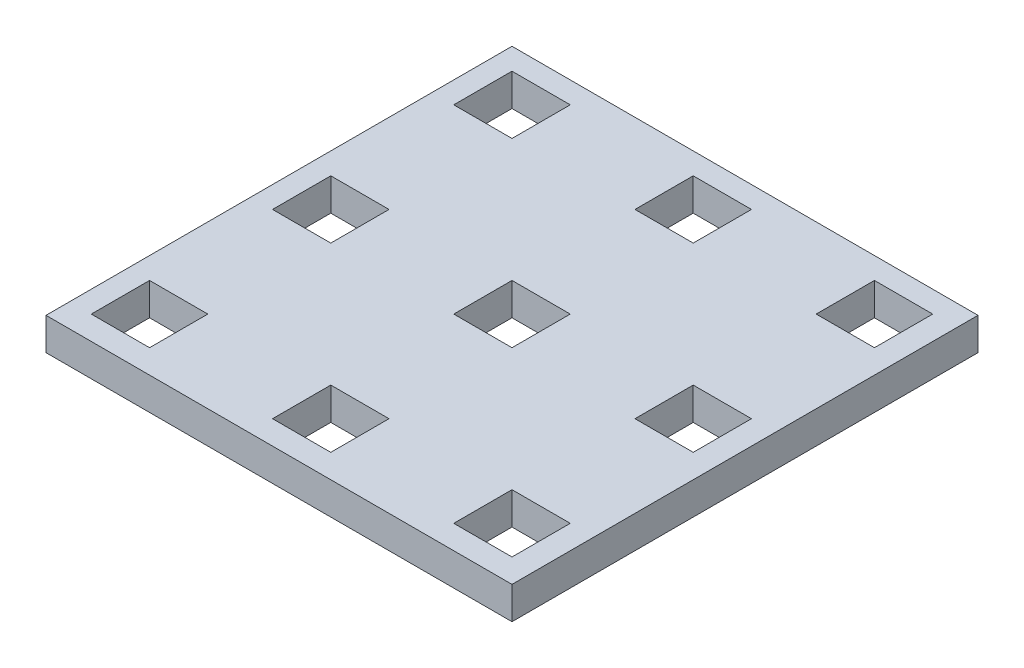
ISO-10303-21;
HEADER;
FILE_DESCRIPTION(('STEP AP214'),'2;1');
FILE_NAME('part.step','',(''),(''),'','','');
FILE_SCHEMA(('AUTOMOTIVE_DESIGN { 1 0 10303 214 1 1 1 1 }'));
ENDSEC;
DATA;
#1=APPLICATION_CONTEXT('core data for automotive mechanical design processes');
#2=APPLICATION_PROTOCOL_DEFINITION('international standard','automotive_design',2000,#1);
#3=PRODUCT_CONTEXT('',#1,'mechanical');
#4=PRODUCT('Part','Part','',(#3));
#5=PRODUCT_RELATED_PRODUCT_CATEGORY('part','',(#4));
#6=PRODUCT_DEFINITION_FORMATION('','',#4);
#7=PRODUCT_DEFINITION_CONTEXT('part definition',#1,'design');
#8=PRODUCT_DEFINITION('design','',#6,#7);
#9=PRODUCT_DEFINITION_SHAPE('','',#8);
#10=(LENGTH_UNIT() NAMED_UNIT(*) SI_UNIT(.MILLI.,.METRE.));
#11=(NAMED_UNIT(*) PLANE_ANGLE_UNIT() SI_UNIT($,.RADIAN.));
#12=(NAMED_UNIT(*) SI_UNIT($,.STERADIAN.) SOLID_ANGLE_UNIT());
#13=UNCERTAINTY_MEASURE_WITH_UNIT(LENGTH_MEASURE(1.E-05),#10,'distance_accuracy_value','');
#14=(GEOMETRIC_REPRESENTATION_CONTEXT(3) GLOBAL_UNCERTAINTY_ASSIGNED_CONTEXT((#13)) GLOBAL_UNIT_ASSIGNED_CONTEXT((#10,
#11,#12)) REPRESENTATION_CONTEXT('',''));
#15=CARTESIAN_POINT('',(0.,0.,0.));
#16=DIRECTION('',(0.,0.,1.));
#17=DIRECTION('',(1.,0.,0.));
#18=AXIS2_PLACEMENT_3D('',#15,#16,#17);
#19=CARTESIAN_POINT('',(21.6,3.,-21.6));
#20=DIRECTION('',(-1.,0.,0.));
#21=DIRECTION('',(0.,0.,1.));
#22=AXIS2_PLACEMENT_3D('',#19,#20,#21);
#23=PLANE('',#22);
#24=DIRECTION('',(0.,0.,-1.));
#25=VECTOR('',#24,1.);
#26=CARTESIAN_POINT('',(21.6,0.,-21.6));
#27=LINE('',#26,#25);
#28=CARTESIAN_POINT('',(21.6,0.,21.6));
#29=VERTEX_POINT('',#28);
#30=CARTESIAN_POINT('',(21.6,0.,-21.6));
#31=VERTEX_POINT('',#30);
#32=EDGE_CURVE('E577',#29,#31,#27,.T.);
#33=ORIENTED_EDGE('',*,*,#32,.T.);
#34=DIRECTION('',(0.,-1.,0.));
#35=VECTOR('',#34,1.);
#36=CARTESIAN_POINT('',(21.6,3.,-21.6));
#37=LINE('',#36,#35);
#38=CARTESIAN_POINT('',(21.6,3.,-21.6));
#39=VERTEX_POINT('',#38);
#40=EDGE_CURVE('E11',#39,#31,#37,.T.);
#41=ORIENTED_EDGE('',*,*,#40,.F.);
#42=DIRECTION('',(0.,0.,-1.));
#43=VECTOR('',#42,1.);
#44=CARTESIAN_POINT('',(21.6,3.,-21.6));
#45=LINE('',#44,#43);
#46=CARTESIAN_POINT('',(21.6,3.,21.6));
#47=VERTEX_POINT('',#46);
#48=EDGE_CURVE('E584',#47,#39,#45,.T.);
#49=ORIENTED_EDGE('',*,*,#48,.F.);
#50=DIRECTION('',(0.,-1.,0.));
#51=VECTOR('',#50,1.);
#52=CARTESIAN_POINT('',(21.6,3.,21.6));
#53=LINE('',#52,#51);
#54=EDGE_CURVE('E594',#47,#29,#53,.T.);
#55=ORIENTED_EDGE('',*,*,#54,.T.);
#56=EDGE_LOOP('',(#33,#41,#49,#55));
#57=FACE_BOUND('',#56,.T.);
#58=ADVANCED_FACE('F35',(#57),#23,.F.);
#59=CARTESIAN_POINT('',(-21.6,3.,-21.6));
#60=DIRECTION('',(0.,0.,1.));
#61=DIRECTION('',(1.,0.,0.));
#62=AXIS2_PLACEMENT_3D('',#59,#60,#61);
#63=PLANE('',#62);
#64=DIRECTION('',(-1.,0.,0.));
#65=VECTOR('',#64,1.);
#66=CARTESIAN_POINT('',(-21.6,0.,-21.6));
#67=LINE('',#66,#65);
#68=CARTESIAN_POINT('',(-21.6,0.,-21.6));
#69=VERTEX_POINT('',#68);
#70=EDGE_CURVE('E597',#31,#69,#67,.T.);
#71=ORIENTED_EDGE('',*,*,#70,.T.);
#72=DIRECTION('',(0.,-1.,0.));
#73=VECTOR('',#72,1.);
#74=CARTESIAN_POINT('',(-21.6,3.,-21.6));
#75=LINE('',#74,#73);
#76=CARTESIAN_POINT('',(-21.6,3.,-21.6));
#77=VERTEX_POINT('',#76);
#78=EDGE_CURVE('E42',#77,#69,#75,.T.);
#79=ORIENTED_EDGE('',*,*,#78,.F.);
#80=DIRECTION('',(-1.,0.,0.));
#81=VECTOR('',#80,1.);
#82=CARTESIAN_POINT('',(-21.6,3.,-21.6));
#83=LINE('',#82,#81);
#84=EDGE_CURVE('E587',#39,#77,#83,.T.);
#85=ORIENTED_EDGE('',*,*,#84,.F.);
#86=ORIENTED_EDGE('',*,*,#40,.T.);
#87=EDGE_LOOP('',(#71,#79,#85,#86));
#88=FACE_BOUND('',#87,.T.);
#89=ADVANCED_FACE('F626',(#88),#63,.F.);
#90=CARTESIAN_POINT('',(-21.6,3.,-21.6));
#91=DIRECTION('',(1.,0.,0.));
#92=DIRECTION('',(0.,0.,-1.));
#93=AXIS2_PLACEMENT_3D('',#90,#91,#92);
#94=PLANE('',#93);
#95=DIRECTION('',(0.,0.,1.));
#96=VECTOR('',#95,1.);
#97=CARTESIAN_POINT('',(-21.6,0.,-21.6));
#98=LINE('',#97,#96);
#99=CARTESIAN_POINT('',(-21.6,0.,21.6));
#100=VERTEX_POINT('',#99);
#101=EDGE_CURVE('E599',#69,#100,#98,.T.);
#102=ORIENTED_EDGE('',*,*,#101,.T.);
#103=DIRECTION('',(0.,-1.,0.));
#104=VECTOR('',#103,1.);
#105=CARTESIAN_POINT('',(-21.6,3.,21.6));
#106=LINE('',#105,#104);
#107=CARTESIAN_POINT('',(-21.6,3.,21.6));
#108=VERTEX_POINT('',#107);
#109=EDGE_CURVE('E604',#108,#100,#106,.T.);
#110=ORIENTED_EDGE('',*,*,#109,.F.);
#111=DIRECTION('',(0.,0.,1.));
#112=VECTOR('',#111,1.);
#113=CARTESIAN_POINT('',(-21.6,3.,-21.6));
#114=LINE('',#113,#112);
#115=EDGE_CURVE('E590',#77,#108,#114,.T.);
#116=ORIENTED_EDGE('',*,*,#115,.F.);
#117=ORIENTED_EDGE('',*,*,#78,.T.);
#118=EDGE_LOOP('',(#102,#110,#116,#117));
#119=FACE_BOUND('',#118,.T.);
#120=ADVANCED_FACE('F611',(#119),#94,.F.);
#121=CARTESIAN_POINT('',(-21.6,3.,21.6));
#122=DIRECTION('',(0.,0.,-1.));
#123=DIRECTION('',(-1.,0.,0.));
#124=AXIS2_PLACEMENT_3D('',#121,#122,#123);
#125=PLANE('',#124);
#126=DIRECTION('',(1.,0.,0.));
#127=VECTOR('',#126,1.);
#128=CARTESIAN_POINT('',(-21.6,0.,21.6));
#129=LINE('',#128,#127);
#130=EDGE_CURVE('E588',#100,#29,#129,.T.);
#131=ORIENTED_EDGE('',*,*,#130,.T.);
#132=ORIENTED_EDGE('',*,*,#54,.F.);
#133=DIRECTION('',(1.,0.,0.));
#134=VECTOR('',#133,1.);
#135=CARTESIAN_POINT('',(-21.6,3.,21.6));
#136=LINE('',#135,#134);
#137=EDGE_CURVE('E592',#108,#47,#136,.T.);
#138=ORIENTED_EDGE('',*,*,#137,.F.);
#139=ORIENTED_EDGE('',*,*,#109,.T.);
#140=EDGE_LOOP('',(#131,#132,#138,#139));
#141=FACE_BOUND('',#140,.T.);
#142=ADVANCED_FACE('F619',(#141),#125,.F.);
#143=CARTESIAN_POINT('',(0.,3.,0.));
#144=DIRECTION('',(0.,1.,0.));
#145=DIRECTION('',(0.,0.,1.));
#146=AXIS2_PLACEMENT_3D('',#143,#144,#145);
#147=PLANE('',#146);
#148=DIRECTION('',(1.,0.,0.));
#149=VECTOR('',#148,1.);
#150=CARTESIAN_POINT('',(-19.5999999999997,3.,19.4));
#151=LINE('',#150,#149);
#152=CARTESIAN_POINT('',(-19.5999999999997,3.,19.4));
#153=VERTEX_POINT('',#152);
#154=CARTESIAN_POINT('',(-14.1999999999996,3.,19.4));
#155=VERTEX_POINT('',#154);
#156=EDGE_CURVE('E49',#153,#155,#151,.T.);
#157=ORIENTED_EDGE('',*,*,#156,.F.);
#158=DIRECTION('',(0.,0.,1.));
#159=VECTOR('',#158,1.);
#160=CARTESIAN_POINT('',(-19.5999999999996,3.,14.));
#161=LINE('',#160,#159);
#162=CARTESIAN_POINT('',(-19.5999999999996,3.,14.));
#163=VERTEX_POINT('',#162);
#164=EDGE_CURVE('E309',#163,#153,#161,.T.);
#165=ORIENTED_EDGE('',*,*,#164,.F.);
#166=DIRECTION('',(-1.,0.,0.));
#167=VECTOR('',#166,1.);
#168=CARTESIAN_POINT('',(-19.5999999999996,3.,14.));
#169=LINE('',#168,#167);
#170=CARTESIAN_POINT('',(-14.1999999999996,3.,14.));
#171=VERTEX_POINT('',#170);
#172=EDGE_CURVE('E312',#171,#163,#169,.T.);
#173=ORIENTED_EDGE('',*,*,#172,.F.);
#174=DIRECTION('',(0.,0.,-1.));
#175=VECTOR('',#174,1.);
#176=CARTESIAN_POINT('',(-14.1999999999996,3.,14.));
#177=LINE('',#176,#175);
#178=EDGE_CURVE('E318',#155,#171,#177,.T.);
#179=ORIENTED_EDGE('',*,*,#178,.F.);
#180=EDGE_LOOP('',(#157,#165,#173,#179));
#181=FACE_BOUND('',#180,.T.);
#182=DIRECTION('',(1.,0.,0.));
#183=VECTOR('',#182,1.);
#184=CARTESIAN_POINT('',(-19.5999999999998,3.,2.6));
#185=LINE('',#184,#183);
#186=CARTESIAN_POINT('',(-19.5999999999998,3.,2.6));
#187=VERTEX_POINT('',#186);
#188=CARTESIAN_POINT('',(-14.1999999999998,3.,2.6));
#189=VERTEX_POINT('',#188);
#190=EDGE_CURVE('E324',#187,#189,#185,.T.);
#191=ORIENTED_EDGE('',*,*,#190,.F.);
#192=DIRECTION('',(0.,0.,1.));
#193=VECTOR('',#192,1.);
#194=CARTESIAN_POINT('',(-19.5999999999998,3.,-2.8));
#195=LINE('',#194,#193);
#196=CARTESIAN_POINT('',(-19.5999999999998,3.,-2.8));
#197=VERTEX_POINT('',#196);
#198=EDGE_CURVE('E332',#197,#187,#195,.T.);
#199=ORIENTED_EDGE('',*,*,#198,.F.);
#200=DIRECTION('',(-1.,0.,0.));
#201=VECTOR('',#200,1.);
#202=CARTESIAN_POINT('',(-19.5999999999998,3.,-2.8));
#203=LINE('',#202,#201);
#204=CARTESIAN_POINT('',(-14.1999999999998,3.,-2.79999999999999));
#205=VERTEX_POINT('',#204);
#206=EDGE_CURVE('E346',#205,#197,#203,.T.);
#207=ORIENTED_EDGE('',*,*,#206,.F.);
#208=DIRECTION('',(0.,0.,-1.));
#209=VECTOR('',#208,1.);
#210=CARTESIAN_POINT('',(-14.1999999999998,3.,-2.79999999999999));
#211=LINE('',#210,#209);
#212=EDGE_CURVE('E343',#189,#205,#211,.T.);
#213=ORIENTED_EDGE('',*,*,#212,.F.);
#214=EDGE_LOOP('',(#191,#199,#207,#213));
#215=FACE_BOUND('',#214,.T.);
#216=DIRECTION('',(1.,0.,0.));
#217=VECTOR('',#216,1.);
#218=CARTESIAN_POINT('',(14.0000000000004,3.,19.3999999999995));
#219=LINE('',#218,#217);
#220=CARTESIAN_POINT('',(14.0000000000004,3.,19.3999999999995));
#221=VERTEX_POINT('',#220);
#222=CARTESIAN_POINT('',(19.4000000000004,3.,19.3999999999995));
#223=VERTEX_POINT('',#222);
#224=EDGE_CURVE('E353',#221,#223,#219,.T.);
#225=ORIENTED_EDGE('',*,*,#224,.F.);
#226=DIRECTION('',(0.,0.,1.));
#227=VECTOR('',#226,1.);
#228=CARTESIAN_POINT('',(14.0000000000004,3.,13.9999999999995));
#229=LINE('',#228,#227);
#230=CARTESIAN_POINT('',(14.0000000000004,3.,13.9999999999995));
#231=VERTEX_POINT('',#230);
#232=EDGE_CURVE('E364',#231,#221,#229,.T.);
#233=ORIENTED_EDGE('',*,*,#232,.F.);
#234=DIRECTION('',(-1.,0.,0.));
#235=VECTOR('',#234,1.);
#236=CARTESIAN_POINT('',(14.0000000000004,3.,13.9999999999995));
#237=LINE('',#236,#235);
#238=CARTESIAN_POINT('',(19.4000000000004,3.,13.9999999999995));
#239=VERTEX_POINT('',#238);
#240=EDGE_CURVE('E378',#239,#231,#237,.T.);
#241=ORIENTED_EDGE('',*,*,#240,.F.);
#242=DIRECTION('',(0.,0.,-1.));
#243=VECTOR('',#242,1.);
#244=CARTESIAN_POINT('',(19.4000000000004,3.,13.9999999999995));
#245=LINE('',#244,#243);
#246=EDGE_CURVE('E375',#223,#239,#245,.T.);
#247=ORIENTED_EDGE('',*,*,#246,.F.);
#248=EDGE_LOOP('',(#225,#233,#241,#247));
#249=FACE_BOUND('',#248,.T.);
#250=DIRECTION('',(1.,0.,0.));
#251=VECTOR('',#250,1.);
#252=CARTESIAN_POINT('',(-2.79999999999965,3.,19.3999999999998));
#253=LINE('',#252,#251);
#254=CARTESIAN_POINT('',(-2.79999999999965,3.,19.3999999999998));
#255=VERTEX_POINT('',#254);
#256=CARTESIAN_POINT('',(2.60000000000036,3.,19.3999999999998));
#257=VERTEX_POINT('',#256);
#258=EDGE_CURVE('E385',#255,#257,#253,.T.);
#259=ORIENTED_EDGE('',*,*,#258,.F.);
#260=DIRECTION('',(0.,0.,1.));
#261=VECTOR('',#260,1.);
#262=CARTESIAN_POINT('',(-2.79999999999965,3.,13.9999999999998));
#263=LINE('',#262,#261);
#264=CARTESIAN_POINT('',(-2.79999999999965,3.,13.9999999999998));
#265=VERTEX_POINT('',#264);
#266=EDGE_CURVE('E396',#265,#255,#263,.T.);
#267=ORIENTED_EDGE('',*,*,#266,.F.);
#268=DIRECTION('',(-1.,0.,0.));
#269=VECTOR('',#268,1.);
#270=CARTESIAN_POINT('',(-2.79999999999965,3.,13.9999999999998));
#271=LINE('',#270,#269);
#272=CARTESIAN_POINT('',(2.60000000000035,3.,13.9999999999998));
#273=VERTEX_POINT('',#272);
#274=EDGE_CURVE('E410',#273,#265,#271,.T.);
#275=ORIENTED_EDGE('',*,*,#274,.F.);
#276=DIRECTION('',(0.,0.,-1.));
#277=VECTOR('',#276,1.);
#278=CARTESIAN_POINT('',(2.60000000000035,3.,13.9999999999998));
#279=LINE('',#278,#277);
#280=EDGE_CURVE('E407',#257,#273,#279,.T.);
#281=ORIENTED_EDGE('',*,*,#280,.F.);
#282=EDGE_LOOP('',(#259,#267,#275,#281));
#283=FACE_BOUND('',#282,.T.);
#284=DIRECTION('',(1.,0.,0.));
#285=VECTOR('',#284,1.);
#286=CARTESIAN_POINT('',(14.0000000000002,3.,2.59999999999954));
#287=LINE('',#286,#285);
#288=CARTESIAN_POINT('',(14.0000000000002,3.,2.59999999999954));
#289=VERTEX_POINT('',#288);
#290=CARTESIAN_POINT('',(19.4000000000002,3.,2.59999999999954));
#291=VERTEX_POINT('',#290);
#292=EDGE_CURVE('E417',#289,#291,#287,.T.);
#293=ORIENTED_EDGE('',*,*,#292,.F.);
#294=DIRECTION('',(0.,0.,1.));
#295=VECTOR('',#294,1.);
#296=CARTESIAN_POINT('',(14.0000000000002,3.,-2.80000000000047));
#297=LINE('',#296,#295);
#298=CARTESIAN_POINT('',(14.0000000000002,3.,-2.80000000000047));
#299=VERTEX_POINT('',#298);
#300=EDGE_CURVE('E428',#299,#289,#297,.T.);
#301=ORIENTED_EDGE('',*,*,#300,.F.);
#302=DIRECTION('',(-1.,0.,0.));
#303=VECTOR('',#302,1.);
#304=CARTESIAN_POINT('',(14.0000000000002,3.,-2.80000000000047));
#305=LINE('',#304,#303);
#306=CARTESIAN_POINT('',(19.4000000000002,3.,-2.80000000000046));
#307=VERTEX_POINT('',#306);
#308=EDGE_CURVE('E442',#307,#299,#305,.T.);
#309=ORIENTED_EDGE('',*,*,#308,.F.);
#310=DIRECTION('',(0.,0.,-1.));
#311=VECTOR('',#310,1.);
#312=CARTESIAN_POINT('',(19.4000000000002,3.,-2.80000000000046));
#313=LINE('',#312,#311);
#314=EDGE_CURVE('E439',#291,#307,#313,.T.);
#315=ORIENTED_EDGE('',*,*,#314,.F.);
#316=EDGE_LOOP('',(#293,#301,#309,#315));
#317=FACE_BOUND('',#316,.T.);
#318=DIRECTION('',(1.,0.,0.));
#319=VECTOR('',#318,1.);
#320=CARTESIAN_POINT('',(-2.79999999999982,3.,2.59999999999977));
#321=LINE('',#320,#319);
#322=CARTESIAN_POINT('',(-2.79999999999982,3.,2.59999999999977));
#323=VERTEX_POINT('',#322);
#324=CARTESIAN_POINT('',(2.60000000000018,3.,2.59999999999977));
#325=VERTEX_POINT('',#324);
#326=EDGE_CURVE('E449',#323,#325,#321,.T.);
#327=ORIENTED_EDGE('',*,*,#326,.F.);
#328=DIRECTION('',(0.,0.,1.));
#329=VECTOR('',#328,1.);
#330=CARTESIAN_POINT('',(-2.79999999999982,3.,-2.80000000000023));
#331=LINE('',#330,#329);
#332=CARTESIAN_POINT('',(-2.79999999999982,3.,-2.80000000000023));
#333=VERTEX_POINT('',#332);
#334=EDGE_CURVE('E460',#333,#323,#331,.T.);
#335=ORIENTED_EDGE('',*,*,#334,.F.);
#336=DIRECTION('',(-1.,0.,0.));
#337=VECTOR('',#336,1.);
#338=CARTESIAN_POINT('',(-2.79999999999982,3.,-2.80000000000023));
#339=LINE('',#338,#337);
#340=CARTESIAN_POINT('',(2.60000000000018,3.,-2.80000000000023));
#341=VERTEX_POINT('',#340);
#342=EDGE_CURVE('E474',#341,#333,#339,.T.);
#343=ORIENTED_EDGE('',*,*,#342,.F.);
#344=DIRECTION('',(0.,0.,-1.));
#345=VECTOR('',#344,1.);
#346=CARTESIAN_POINT('',(2.60000000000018,3.,-2.80000000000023));
#347=LINE('',#346,#345);
#348=EDGE_CURVE('E471',#325,#341,#347,.T.);
#349=ORIENTED_EDGE('',*,*,#348,.F.);
#350=EDGE_LOOP('',(#327,#335,#343,#349));
#351=FACE_BOUND('',#350,.T.);
#352=DIRECTION('',(1.,0.,0.));
#353=VECTOR('',#352,1.);
#354=CARTESIAN_POINT('',(14.,3.,-14.2000000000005));
#355=LINE('',#354,#353);
#356=CARTESIAN_POINT('',(14.,3.,-14.2000000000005));
#357=VERTEX_POINT('',#356);
#358=CARTESIAN_POINT('',(19.4,3.,-14.2000000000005));
#359=VERTEX_POINT('',#358);
#360=EDGE_CURVE('E481',#357,#359,#355,.T.);
#361=ORIENTED_EDGE('',*,*,#360,.F.);
#362=DIRECTION('',(0.,0.,1.));
#363=VECTOR('',#362,1.);
#364=CARTESIAN_POINT('',(14.,3.,-19.6000000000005));
#365=LINE('',#364,#363);
#366=CARTESIAN_POINT('',(14.,3.,-19.6000000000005));
#367=VERTEX_POINT('',#366);
#368=EDGE_CURVE('E492',#367,#357,#365,.T.);
#369=ORIENTED_EDGE('',*,*,#368,.F.);
#370=DIRECTION('',(-1.,0.,0.));
#371=VECTOR('',#370,1.);
#372=CARTESIAN_POINT('',(14.,3.,-19.6000000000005));
#373=LINE('',#372,#371);
#374=CARTESIAN_POINT('',(19.4,3.,-19.6000000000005));
#375=VERTEX_POINT('',#374);
#376=EDGE_CURVE('E506',#375,#367,#373,.T.);
#377=ORIENTED_EDGE('',*,*,#376,.F.);
#378=DIRECTION('',(0.,0.,-1.));
#379=VECTOR('',#378,1.);
#380=CARTESIAN_POINT('',(19.4,3.,-19.6000000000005));
#381=LINE('',#380,#379);
#382=EDGE_CURVE('E503',#359,#375,#381,.T.);
#383=ORIENTED_EDGE('',*,*,#382,.F.);
#384=EDGE_LOOP('',(#361,#369,#377,#383));
#385=FACE_BOUND('',#384,.T.);
#386=DIRECTION('',(1.,0.,0.));
#387=VECTOR('',#386,1.);
#388=CARTESIAN_POINT('',(-2.8,3.,-14.2000000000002));
#389=LINE('',#388,#387);
#390=CARTESIAN_POINT('',(-2.8,3.,-14.2000000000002));
#391=VERTEX_POINT('',#390);
#392=CARTESIAN_POINT('',(2.6,3.,-14.2000000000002));
#393=VERTEX_POINT('',#392);
#394=EDGE_CURVE('E513',#391,#393,#389,.T.);
#395=ORIENTED_EDGE('',*,*,#394,.F.);
#396=DIRECTION('',(0.,0.,1.));
#397=VECTOR('',#396,1.);
#398=CARTESIAN_POINT('',(-2.8,3.,-19.6000000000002));
#399=LINE('',#398,#397);
#400=CARTESIAN_POINT('',(-2.8,3.,-19.6000000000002));
#401=VERTEX_POINT('',#400);
#402=EDGE_CURVE('E524',#401,#391,#399,.T.);
#403=ORIENTED_EDGE('',*,*,#402,.F.);
#404=DIRECTION('',(-1.,0.,0.));
#405=VECTOR('',#404,1.);
#406=CARTESIAN_POINT('',(-2.8,3.,-19.6000000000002));
#407=LINE('',#406,#405);
#408=CARTESIAN_POINT('',(2.6,3.,-19.6000000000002));
#409=VERTEX_POINT('',#408);
#410=EDGE_CURVE('E538',#409,#401,#407,.T.);
#411=ORIENTED_EDGE('',*,*,#410,.F.);
#412=DIRECTION('',(0.,0.,-1.));
#413=VECTOR('',#412,1.);
#414=CARTESIAN_POINT('',(2.6,3.,-19.6000000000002));
#415=LINE('',#414,#413);
#416=EDGE_CURVE('E535',#393,#409,#415,.T.);
#417=ORIENTED_EDGE('',*,*,#416,.F.);
#418=EDGE_LOOP('',(#395,#403,#411,#417));
#419=FACE_BOUND('',#418,.T.);
#420=DIRECTION('',(0.,0.,-1.));
#421=VECTOR('',#420,1.);
#422=CARTESIAN_POINT('',(-14.2,3.,-19.6));
#423=LINE('',#422,#421);
#424=CARTESIAN_POINT('',(-14.2,3.,-14.2));
#425=VERTEX_POINT('',#424);
#426=CARTESIAN_POINT('',(-14.2,3.,-19.6));
#427=VERTEX_POINT('',#426);
#428=EDGE_CURVE('E545',#425,#427,#423,.T.);
#429=ORIENTED_EDGE('',*,*,#428,.F.);
#430=DIRECTION('',(1.,0.,0.));
#431=VECTOR('',#430,1.);
#432=CARTESIAN_POINT('',(-19.6,3.,-14.2));
#433=LINE('',#432,#431);
#434=CARTESIAN_POINT('',(-19.6,3.,-14.2));
#435=VERTEX_POINT('',#434);
#436=EDGE_CURVE('E556',#435,#425,#433,.T.);
#437=ORIENTED_EDGE('',*,*,#436,.F.);
#438=DIRECTION('',(0.,0.,1.));
#439=VECTOR('',#438,1.);
#440=CARTESIAN_POINT('',(-19.6,3.,-19.6));
#441=LINE('',#440,#439);
#442=CARTESIAN_POINT('',(-19.6,3.,-19.6));
#443=VERTEX_POINT('',#442);
#444=EDGE_CURVE('E570',#443,#435,#441,.T.);
#445=ORIENTED_EDGE('',*,*,#444,.F.);
#446=DIRECTION('',(-1.,0.,0.));
#447=VECTOR('',#446,1.);
#448=CARTESIAN_POINT('',(-19.6,3.,-19.6));
#449=LINE('',#448,#447);
#450=EDGE_CURVE('E567',#427,#443,#449,.T.);
#451=ORIENTED_EDGE('',*,*,#450,.F.);
#452=EDGE_LOOP('',(#429,#437,#445,#451));
#453=FACE_BOUND('',#452,.T.);
#454=ORIENTED_EDGE('',*,*,#48,.T.);
#455=ORIENTED_EDGE('',*,*,#84,.T.);
#456=ORIENTED_EDGE('',*,*,#115,.T.);
#457=ORIENTED_EDGE('',*,*,#137,.T.);
#458=EDGE_LOOP('',(#454,#455,#456,#457));
#459=FACE_BOUND('',#458,.T.);
#460=ADVANCED_FACE('F625',(#181,#215,#249,#283,#317,#351,#385,#419,#453,#459),#147,.T.);
#461=CARTESIAN_POINT('',(0.,0.,0.));
#462=DIRECTION('',(0.,1.,0.));
#463=DIRECTION('',(0.,0.,1.));
#464=AXIS2_PLACEMENT_3D('',#461,#462,#463);
#465=PLANE('',#464);
#466=DIRECTION('',(0.,0.,1.));
#467=VECTOR('',#466,1.);
#468=CARTESIAN_POINT('',(-19.5999999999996,0.,14.));
#469=LINE('',#468,#467);
#470=CARTESIAN_POINT('',(-19.5999999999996,0.,14.));
#471=VERTEX_POINT('',#470);
#472=CARTESIAN_POINT('',(-19.5999999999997,0.,19.4));
#473=VERTEX_POINT('',#472);
#474=EDGE_CURVE('E299',#471,#473,#469,.T.);
#475=ORIENTED_EDGE('',*,*,#474,.T.);
#476=DIRECTION('',(1.,0.,0.));
#477=VECTOR('',#476,1.);
#478=CARTESIAN_POINT('',(-19.5999999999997,0.,19.4));
#479=LINE('',#478,#477);
#480=CARTESIAN_POINT('',(-14.1999999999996,0.,19.4));
#481=VERTEX_POINT('',#480);
#482=EDGE_CURVE('E293',#473,#481,#479,.T.);
#483=ORIENTED_EDGE('',*,*,#482,.T.);
#484=DIRECTION('',(0.,0.,-1.));
#485=VECTOR('',#484,1.);
#486=CARTESIAN_POINT('',(-14.1999999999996,0.,14.));
#487=LINE('',#486,#485);
#488=CARTESIAN_POINT('',(-14.1999999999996,0.,14.));
#489=VERTEX_POINT('',#488);
#490=EDGE_CURVE('E302',#481,#489,#487,.T.);
#491=ORIENTED_EDGE('',*,*,#490,.T.);
#492=DIRECTION('',(-1.,0.,0.));
#493=VECTOR('',#492,1.);
#494=CARTESIAN_POINT('',(-19.5999999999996,0.,14.));
#495=LINE('',#494,#493);
#496=EDGE_CURVE('E57',#489,#471,#495,.T.);
#497=ORIENTED_EDGE('',*,*,#496,.T.);
#498=EDGE_LOOP('',(#475,#483,#491,#497));
#499=FACE_BOUND('',#498,.T.);
#500=DIRECTION('',(0.,0.,1.));
#501=VECTOR('',#500,1.);
#502=CARTESIAN_POINT('',(-19.5999999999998,0.,-2.8));
#503=LINE('',#502,#501);
#504=CARTESIAN_POINT('',(-19.5999999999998,0.,-2.8));
#505=VERTEX_POINT('',#504);
#506=CARTESIAN_POINT('',(-19.5999999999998,0.,2.6));
#507=VERTEX_POINT('',#506);
#508=EDGE_CURVE('E338',#505,#507,#503,.T.);
#509=ORIENTED_EDGE('',*,*,#508,.T.);
#510=DIRECTION('',(1.,0.,0.));
#511=VECTOR('',#510,1.);
#512=CARTESIAN_POINT('',(-19.5999999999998,0.,2.6));
#513=LINE('',#512,#511);
#514=CARTESIAN_POINT('',(-14.1999999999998,0.,2.6));
#515=VERTEX_POINT('',#514);
#516=EDGE_CURVE('E328',#507,#515,#513,.T.);
#517=ORIENTED_EDGE('',*,*,#516,.T.);
#518=DIRECTION('',(0.,0.,-1.));
#519=VECTOR('',#518,1.);
#520=CARTESIAN_POINT('',(-14.1999999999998,0.,-2.79999999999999));
#521=LINE('',#520,#519);
#522=CARTESIAN_POINT('',(-14.1999999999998,0.,-2.79999999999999));
#523=VERTEX_POINT('',#522);
#524=EDGE_CURVE('E331',#515,#523,#521,.T.);
#525=ORIENTED_EDGE('',*,*,#524,.T.);
#526=DIRECTION('',(-1.,0.,0.));
#527=VECTOR('',#526,1.);
#528=CARTESIAN_POINT('',(-19.5999999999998,0.,-2.8));
#529=LINE('',#528,#527);
#530=EDGE_CURVE('E335',#523,#505,#529,.T.);
#531=ORIENTED_EDGE('',*,*,#530,.T.);
#532=EDGE_LOOP('',(#509,#517,#525,#531));
#533=FACE_BOUND('',#532,.T.);
#534=DIRECTION('',(0.,0.,1.));
#535=VECTOR('',#534,1.);
#536=CARTESIAN_POINT('',(14.0000000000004,0.,13.9999999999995));
#537=LINE('',#536,#535);
#538=CARTESIAN_POINT('',(14.0000000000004,0.,13.9999999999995));
#539=VERTEX_POINT('',#538);
#540=CARTESIAN_POINT('',(14.0000000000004,0.,19.3999999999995));
#541=VERTEX_POINT('',#540);
#542=EDGE_CURVE('E370',#539,#541,#537,.T.);
#543=ORIENTED_EDGE('',*,*,#542,.T.);
#544=DIRECTION('',(1.,0.,0.));
#545=VECTOR('',#544,1.);
#546=CARTESIAN_POINT('',(14.0000000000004,0.,19.3999999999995));
#547=LINE('',#546,#545);
#548=CARTESIAN_POINT('',(19.4000000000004,0.,19.3999999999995));
#549=VERTEX_POINT('',#548);
#550=EDGE_CURVE('E360',#541,#549,#547,.T.);
#551=ORIENTED_EDGE('',*,*,#550,.T.);
#552=DIRECTION('',(0.,0.,-1.));
#553=VECTOR('',#552,1.);
#554=CARTESIAN_POINT('',(19.4000000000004,0.,13.9999999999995));
#555=LINE('',#554,#553);
#556=CARTESIAN_POINT('',(19.4000000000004,0.,13.9999999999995));
#557=VERTEX_POINT('',#556);
#558=EDGE_CURVE('E363',#549,#557,#555,.T.);
#559=ORIENTED_EDGE('',*,*,#558,.T.);
#560=DIRECTION('',(-1.,0.,0.));
#561=VECTOR('',#560,1.);
#562=CARTESIAN_POINT('',(14.0000000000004,0.,13.9999999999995));
#563=LINE('',#562,#561);
#564=EDGE_CURVE('E367',#557,#539,#563,.T.);
#565=ORIENTED_EDGE('',*,*,#564,.T.);
#566=EDGE_LOOP('',(#543,#551,#559,#565));
#567=FACE_BOUND('',#566,.T.);
#568=DIRECTION('',(0.,0.,1.));
#569=VECTOR('',#568,1.);
#570=CARTESIAN_POINT('',(-2.79999999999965,0.,13.9999999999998));
#571=LINE('',#570,#569);
#572=CARTESIAN_POINT('',(-2.79999999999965,0.,13.9999999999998));
#573=VERTEX_POINT('',#572);
#574=CARTESIAN_POINT('',(-2.79999999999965,0.,19.3999999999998));
#575=VERTEX_POINT('',#574);
#576=EDGE_CURVE('E402',#573,#575,#571,.T.);
#577=ORIENTED_EDGE('',*,*,#576,.T.);
#578=DIRECTION('',(1.,0.,0.));
#579=VECTOR('',#578,1.);
#580=CARTESIAN_POINT('',(-2.79999999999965,0.,19.3999999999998));
#581=LINE('',#580,#579);
#582=CARTESIAN_POINT('',(2.60000000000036,0.,19.3999999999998));
#583=VERTEX_POINT('',#582);
#584=EDGE_CURVE('E392',#575,#583,#581,.T.);
#585=ORIENTED_EDGE('',*,*,#584,.T.);
#586=DIRECTION('',(0.,0.,-1.));
#587=VECTOR('',#586,1.);
#588=CARTESIAN_POINT('',(2.60000000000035,0.,13.9999999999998));
#589=LINE('',#588,#587);
#590=CARTESIAN_POINT('',(2.60000000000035,0.,13.9999999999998));
#591=VERTEX_POINT('',#590);
#592=EDGE_CURVE('E395',#583,#591,#589,.T.);
#593=ORIENTED_EDGE('',*,*,#592,.T.);
#594=DIRECTION('',(-1.,0.,0.));
#595=VECTOR('',#594,1.);
#596=CARTESIAN_POINT('',(-2.79999999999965,0.,13.9999999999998));
#597=LINE('',#596,#595);
#598=EDGE_CURVE('E399',#591,#573,#597,.T.);
#599=ORIENTED_EDGE('',*,*,#598,.T.);
#600=EDGE_LOOP('',(#577,#585,#593,#599));
#601=FACE_BOUND('',#600,.T.);
#602=DIRECTION('',(0.,0.,1.));
#603=VECTOR('',#602,1.);
#604=CARTESIAN_POINT('',(14.0000000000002,0.,-2.80000000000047));
#605=LINE('',#604,#603);
#606=CARTESIAN_POINT('',(14.0000000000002,0.,-2.80000000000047));
#607=VERTEX_POINT('',#606);
#608=CARTESIAN_POINT('',(14.0000000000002,0.,2.59999999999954));
#609=VERTEX_POINT('',#608);
#610=EDGE_CURVE('E434',#607,#609,#605,.T.);
#611=ORIENTED_EDGE('',*,*,#610,.T.);
#612=DIRECTION('',(1.,0.,0.));
#613=VECTOR('',#612,1.);
#614=CARTESIAN_POINT('',(14.0000000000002,0.,2.59999999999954));
#615=LINE('',#614,#613);
#616=CARTESIAN_POINT('',(19.4000000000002,0.,2.59999999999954));
#617=VERTEX_POINT('',#616);
#618=EDGE_CURVE('E424',#609,#617,#615,.T.);
#619=ORIENTED_EDGE('',*,*,#618,.T.);
#620=DIRECTION('',(0.,0.,-1.));
#621=VECTOR('',#620,1.);
#622=CARTESIAN_POINT('',(19.4000000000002,0.,-2.80000000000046));
#623=LINE('',#622,#621);
#624=CARTESIAN_POINT('',(19.4000000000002,0.,-2.80000000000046));
#625=VERTEX_POINT('',#624);
#626=EDGE_CURVE('E427',#617,#625,#623,.T.);
#627=ORIENTED_EDGE('',*,*,#626,.T.);
#628=DIRECTION('',(-1.,0.,0.));
#629=VECTOR('',#628,1.);
#630=CARTESIAN_POINT('',(14.0000000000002,0.,-2.80000000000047));
#631=LINE('',#630,#629);
#632=EDGE_CURVE('E431',#625,#607,#631,.T.);
#633=ORIENTED_EDGE('',*,*,#632,.T.);
#634=EDGE_LOOP('',(#611,#619,#627,#633));
#635=FACE_BOUND('',#634,.T.);
#636=DIRECTION('',(0.,0.,1.));
#637=VECTOR('',#636,1.);
#638=CARTESIAN_POINT('',(-2.79999999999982,0.,-2.80000000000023));
#639=LINE('',#638,#637);
#640=CARTESIAN_POINT('',(-2.79999999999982,0.,-2.80000000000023));
#641=VERTEX_POINT('',#640);
#642=CARTESIAN_POINT('',(-2.79999999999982,0.,2.59999999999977));
#643=VERTEX_POINT('',#642);
#644=EDGE_CURVE('E466',#641,#643,#639,.T.);
#645=ORIENTED_EDGE('',*,*,#644,.T.);
#646=DIRECTION('',(1.,0.,0.));
#647=VECTOR('',#646,1.);
#648=CARTESIAN_POINT('',(-2.79999999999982,0.,2.59999999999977));
#649=LINE('',#648,#647);
#650=CARTESIAN_POINT('',(2.60000000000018,0.,2.59999999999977));
#651=VERTEX_POINT('',#650);
#652=EDGE_CURVE('E456',#643,#651,#649,.T.);
#653=ORIENTED_EDGE('',*,*,#652,.T.);
#654=DIRECTION('',(0.,0.,-1.));
#655=VECTOR('',#654,1.);
#656=CARTESIAN_POINT('',(2.60000000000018,0.,-2.80000000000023));
#657=LINE('',#656,#655);
#658=CARTESIAN_POINT('',(2.60000000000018,0.,-2.80000000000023));
#659=VERTEX_POINT('',#658);
#660=EDGE_CURVE('E459',#651,#659,#657,.T.);
#661=ORIENTED_EDGE('',*,*,#660,.T.);
#662=DIRECTION('',(-1.,0.,0.));
#663=VECTOR('',#662,1.);
#664=CARTESIAN_POINT('',(-2.79999999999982,0.,-2.80000000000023));
#665=LINE('',#664,#663);
#666=EDGE_CURVE('E463',#659,#641,#665,.T.);
#667=ORIENTED_EDGE('',*,*,#666,.T.);
#668=EDGE_LOOP('',(#645,#653,#661,#667));
#669=FACE_BOUND('',#668,.T.);
#670=DIRECTION('',(0.,0.,1.));
#671=VECTOR('',#670,1.);
#672=CARTESIAN_POINT('',(14.,0.,-19.6000000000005));
#673=LINE('',#672,#671);
#674=CARTESIAN_POINT('',(14.,0.,-19.6000000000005));
#675=VERTEX_POINT('',#674);
#676=CARTESIAN_POINT('',(14.,0.,-14.2000000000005));
#677=VERTEX_POINT('',#676);
#678=EDGE_CURVE('E498',#675,#677,#673,.T.);
#679=ORIENTED_EDGE('',*,*,#678,.T.);
#680=DIRECTION('',(1.,0.,0.));
#681=VECTOR('',#680,1.);
#682=CARTESIAN_POINT('',(14.,0.,-14.2000000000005));
#683=LINE('',#682,#681);
#684=CARTESIAN_POINT('',(19.4,0.,-14.2000000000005));
#685=VERTEX_POINT('',#684);
#686=EDGE_CURVE('E488',#677,#685,#683,.T.);
#687=ORIENTED_EDGE('',*,*,#686,.T.);
#688=DIRECTION('',(0.,0.,-1.));
#689=VECTOR('',#688,1.);
#690=CARTESIAN_POINT('',(19.4,0.,-19.6000000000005));
#691=LINE('',#690,#689);
#692=CARTESIAN_POINT('',(19.4,0.,-19.6000000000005));
#693=VERTEX_POINT('',#692);
#694=EDGE_CURVE('E491',#685,#693,#691,.T.);
#695=ORIENTED_EDGE('',*,*,#694,.T.);
#696=DIRECTION('',(-1.,0.,0.));
#697=VECTOR('',#696,1.);
#698=CARTESIAN_POINT('',(14.,0.,-19.6000000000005));
#699=LINE('',#698,#697);
#700=EDGE_CURVE('E495',#693,#675,#699,.T.);
#701=ORIENTED_EDGE('',*,*,#700,.T.);
#702=EDGE_LOOP('',(#679,#687,#695,#701));
#703=FACE_BOUND('',#702,.T.);
#704=DIRECTION('',(0.,0.,1.));
#705=VECTOR('',#704,1.);
#706=CARTESIAN_POINT('',(-2.8,0.,-19.6000000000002));
#707=LINE('',#706,#705);
#708=CARTESIAN_POINT('',(-2.8,0.,-19.6000000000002));
#709=VERTEX_POINT('',#708);
#710=CARTESIAN_POINT('',(-2.8,0.,-14.2000000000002));
#711=VERTEX_POINT('',#710);
#712=EDGE_CURVE('E530',#709,#711,#707,.T.);
#713=ORIENTED_EDGE('',*,*,#712,.T.);
#714=DIRECTION('',(1.,0.,0.));
#715=VECTOR('',#714,1.);
#716=CARTESIAN_POINT('',(-2.8,0.,-14.2000000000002));
#717=LINE('',#716,#715);
#718=CARTESIAN_POINT('',(2.6,0.,-14.2000000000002));
#719=VERTEX_POINT('',#718);
#720=EDGE_CURVE('E520',#711,#719,#717,.T.);
#721=ORIENTED_EDGE('',*,*,#720,.T.);
#722=DIRECTION('',(0.,0.,-1.));
#723=VECTOR('',#722,1.);
#724=CARTESIAN_POINT('',(2.6,0.,-19.6000000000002));
#725=LINE('',#724,#723);
#726=CARTESIAN_POINT('',(2.6,0.,-19.6000000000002));
#727=VERTEX_POINT('',#726);
#728=EDGE_CURVE('E523',#719,#727,#725,.T.);
#729=ORIENTED_EDGE('',*,*,#728,.T.);
#730=DIRECTION('',(-1.,0.,0.));
#731=VECTOR('',#730,1.);
#732=CARTESIAN_POINT('',(-2.8,0.,-19.6000000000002));
#733=LINE('',#732,#731);
#734=EDGE_CURVE('E527',#727,#709,#733,.T.);
#735=ORIENTED_EDGE('',*,*,#734,.T.);
#736=EDGE_LOOP('',(#713,#721,#729,#735));
#737=FACE_BOUND('',#736,.T.);
#738=DIRECTION('',(1.,0.,0.));
#739=VECTOR('',#738,1.);
#740=CARTESIAN_POINT('',(-19.6,0.,-14.2));
#741=LINE('',#740,#739);
#742=CARTESIAN_POINT('',(-19.6,0.,-14.2));
#743=VERTEX_POINT('',#742);
#744=CARTESIAN_POINT('',(-14.2,0.,-14.2));
#745=VERTEX_POINT('',#744);
#746=EDGE_CURVE('E562',#743,#745,#741,.T.);
#747=ORIENTED_EDGE('',*,*,#746,.T.);
#748=DIRECTION('',(0.,0.,-1.));
#749=VECTOR('',#748,1.);
#750=CARTESIAN_POINT('',(-14.2,0.,-19.6));
#751=LINE('',#750,#749);
#752=CARTESIAN_POINT('',(-14.2,0.,-19.6));
#753=VERTEX_POINT('',#752);
#754=EDGE_CURVE('E552',#745,#753,#751,.T.);
#755=ORIENTED_EDGE('',*,*,#754,.T.);
#756=DIRECTION('',(-1.,0.,0.));
#757=VECTOR('',#756,1.);
#758=CARTESIAN_POINT('',(-19.6,0.,-19.6));
#759=LINE('',#758,#757);
#760=CARTESIAN_POINT('',(-19.6,0.,-19.6));
#761=VERTEX_POINT('',#760);
#762=EDGE_CURVE('E555',#753,#761,#759,.T.);
#763=ORIENTED_EDGE('',*,*,#762,.T.);
#764=DIRECTION('',(0.,0.,1.));
#765=VECTOR('',#764,1.);
#766=CARTESIAN_POINT('',(-19.6,0.,-19.6));
#767=LINE('',#766,#765);
#768=EDGE_CURVE('E559',#761,#743,#767,.T.);
#769=ORIENTED_EDGE('',*,*,#768,.T.);
#770=EDGE_LOOP('',(#747,#755,#763,#769));
#771=FACE_BOUND('',#770,.T.);
#772=ORIENTED_EDGE('',*,*,#32,.F.);
#773=ORIENTED_EDGE('',*,*,#130,.F.);
#774=ORIENTED_EDGE('',*,*,#101,.F.);
#775=ORIENTED_EDGE('',*,*,#70,.F.);
#776=EDGE_LOOP('',(#772,#773,#774,#775));
#777=FACE_BOUND('',#776,.T.);
#778=ADVANCED_FACE('F306',(#499,#533,#567,#601,#635,#669,#703,#737,#771,#777),#465,.F.);
#779=CARTESIAN_POINT('',(-14.2,0.,-19.6));
#780=DIRECTION('',(1.,0.,0.));
#781=DIRECTION('',(0.,0.,-1.));
#782=AXIS2_PLACEMENT_3D('',#779,#780,#781);
#783=PLANE('',#782);
#784=ORIENTED_EDGE('',*,*,#428,.T.);
#785=DIRECTION('',(0.,1.,0.));
#786=VECTOR('',#785,1.);
#787=CARTESIAN_POINT('',(-14.2,0.,-19.6));
#788=LINE('',#787,#786);
#789=EDGE_CURVE('E565',#753,#427,#788,.T.);
#790=ORIENTED_EDGE('',*,*,#789,.F.);
#791=ORIENTED_EDGE('',*,*,#754,.F.);
#792=DIRECTION('',(0.,1.,0.));
#793=VECTOR('',#792,1.);
#794=CARTESIAN_POINT('',(-14.2,0.,-14.2));
#795=LINE('',#794,#793);
#796=EDGE_CURVE('E575',#745,#425,#795,.T.);
#797=ORIENTED_EDGE('',*,*,#796,.T.);
#798=EDGE_LOOP('',(#784,#790,#791,#797));
#799=FACE_BOUND('',#798,.T.);
#800=ADVANCED_FACE('F638',(#799),#783,.F.);
#801=CARTESIAN_POINT('',(-19.6,0.,-14.2));
#802=DIRECTION('',(0.,0.,1.));
#803=DIRECTION('',(1.,0.,0.));
#804=AXIS2_PLACEMENT_3D('',#801,#802,#803);
#805=PLANE('',#804);
#806=ORIENTED_EDGE('',*,*,#436,.T.);
#807=ORIENTED_EDGE('',*,*,#796,.F.);
#808=ORIENTED_EDGE('',*,*,#746,.F.);
#809=DIRECTION('',(0.,1.,0.));
#810=VECTOR('',#809,1.);
#811=CARTESIAN_POINT('',(-19.6,0.,-14.2));
#812=LINE('',#811,#810);
#813=EDGE_CURVE('E578',#743,#435,#812,.T.);
#814=ORIENTED_EDGE('',*,*,#813,.T.);
#815=EDGE_LOOP('',(#806,#807,#808,#814));
#816=FACE_BOUND('',#815,.T.);
#817=ADVANCED_FACE('F644',(#816),#805,.F.);
#818=CARTESIAN_POINT('',(-19.6,0.,-19.6));
#819=DIRECTION('',(-1.,0.,0.));
#820=DIRECTION('',(0.,0.,1.));
#821=AXIS2_PLACEMENT_3D('',#818,#819,#820);
#822=PLANE('',#821);
#823=ORIENTED_EDGE('',*,*,#444,.T.);
#824=ORIENTED_EDGE('',*,*,#813,.F.);
#825=ORIENTED_EDGE('',*,*,#768,.F.);
#826=DIRECTION('',(0.,1.,0.));
#827=VECTOR('',#826,1.);
#828=CARTESIAN_POINT('',(-19.6,0.,-19.6));
#829=LINE('',#828,#827);
#830=EDGE_CURVE('E580',#761,#443,#829,.T.);
#831=ORIENTED_EDGE('',*,*,#830,.T.);
#832=EDGE_LOOP('',(#823,#824,#825,#831));
#833=FACE_BOUND('',#832,.T.);
#834=ADVANCED_FACE('F650',(#833),#822,.F.);
#835=CARTESIAN_POINT('',(-19.6,0.,-19.6));
#836=DIRECTION('',(0.,0.,-1.));
#837=DIRECTION('',(-1.,0.,0.));
#838=AXIS2_PLACEMENT_3D('',#835,#836,#837);
#839=PLANE('',#838);
#840=ORIENTED_EDGE('',*,*,#450,.T.);
#841=ORIENTED_EDGE('',*,*,#830,.F.);
#842=ORIENTED_EDGE('',*,*,#762,.F.);
#843=ORIENTED_EDGE('',*,*,#789,.T.);
#844=EDGE_LOOP('',(#840,#841,#842,#843));
#845=FACE_BOUND('',#844,.T.);
#846=ADVANCED_FACE('F646',(#845),#839,.F.);
#847=CARTESIAN_POINT('',(-2.8,0.,-14.2000000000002));
#848=DIRECTION('',(0.,0.,1.));
#849=DIRECTION('',(1.,0.,0.));
#850=AXIS2_PLACEMENT_3D('',#847,#848,#849);
#851=PLANE('',#850);
#852=ORIENTED_EDGE('',*,*,#394,.T.);
#853=DIRECTION('',(0.,1.,0.));
#854=VECTOR('',#853,1.);
#855=CARTESIAN_POINT('',(2.6,0.,-14.2000000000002));
#856=LINE('',#855,#854);
#857=EDGE_CURVE('E533',#719,#393,#856,.T.);
#858=ORIENTED_EDGE('',*,*,#857,.F.);
#859=ORIENTED_EDGE('',*,*,#720,.F.);
#860=DIRECTION('',(0.,1.,0.));
#861=VECTOR('',#860,1.);
#862=CARTESIAN_POINT('',(-2.8,0.,-14.2000000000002));
#863=LINE('',#862,#861);
#864=EDGE_CURVE('E543',#711,#391,#863,.T.);
#865=ORIENTED_EDGE('',*,*,#864,.T.);
#866=EDGE_LOOP('',(#852,#858,#859,#865));
#867=FACE_BOUND('',#866,.T.);
#868=ADVANCED_FACE('F649',(#867),#851,.F.);
#869=CARTESIAN_POINT('',(-2.8,0.,-19.6000000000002));
#870=DIRECTION('',(-1.,0.,0.));
#871=DIRECTION('',(0.,0.,1.));
#872=AXIS2_PLACEMENT_3D('',#869,#870,#871);
#873=PLANE('',#872);
#874=ORIENTED_EDGE('',*,*,#402,.T.);
#875=ORIENTED_EDGE('',*,*,#864,.F.);
#876=ORIENTED_EDGE('',*,*,#712,.F.);
#877=DIRECTION('',(0.,1.,0.));
#878=VECTOR('',#877,1.);
#879=CARTESIAN_POINT('',(-2.8,0.,-19.6000000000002));
#880=LINE('',#879,#878);
#881=EDGE_CURVE('E546',#709,#401,#880,.T.);
#882=ORIENTED_EDGE('',*,*,#881,.T.);
#883=EDGE_LOOP('',(#874,#875,#876,#882));
#884=FACE_BOUND('',#883,.T.);
#885=ADVANCED_FACE('F660',(#884),#873,.F.);
#886=CARTESIAN_POINT('',(-2.8,0.,-19.6000000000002));
#887=DIRECTION('',(0.,0.,-1.));
#888=DIRECTION('',(-1.,0.,0.));
#889=AXIS2_PLACEMENT_3D('',#886,#887,#888);
#890=PLANE('',#889);
#891=ORIENTED_EDGE('',*,*,#410,.T.);
#892=ORIENTED_EDGE('',*,*,#881,.F.);
#893=ORIENTED_EDGE('',*,*,#734,.F.);
#894=DIRECTION('',(0.,1.,0.));
#895=VECTOR('',#894,1.);
#896=CARTESIAN_POINT('',(2.6,0.,-19.6000000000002));
#897=LINE('',#896,#895);
#898=EDGE_CURVE('E548',#727,#409,#897,.T.);
#899=ORIENTED_EDGE('',*,*,#898,.T.);
#900=EDGE_LOOP('',(#891,#892,#893,#899));
#901=FACE_BOUND('',#900,.T.);
#902=ADVANCED_FACE('F666',(#901),#890,.F.);
#903=CARTESIAN_POINT('',(2.6,0.,-19.6000000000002));
#904=DIRECTION('',(1.,0.,0.));
#905=DIRECTION('',(0.,0.,-1.));
#906=AXIS2_PLACEMENT_3D('',#903,#904,#905);
#907=PLANE('',#906);
#908=ORIENTED_EDGE('',*,*,#416,.T.);
#909=ORIENTED_EDGE('',*,*,#898,.F.);
#910=ORIENTED_EDGE('',*,*,#728,.F.);
#911=ORIENTED_EDGE('',*,*,#857,.T.);
#912=EDGE_LOOP('',(#908,#909,#910,#911));
#913=FACE_BOUND('',#912,.T.);
#914=ADVANCED_FACE('F662',(#913),#907,.F.);
#915=CARTESIAN_POINT('',(14.,0.,-14.2000000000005));
#916=DIRECTION('',(0.,0.,1.));
#917=DIRECTION('',(1.,0.,0.));
#918=AXIS2_PLACEMENT_3D('',#915,#916,#917);
#919=PLANE('',#918);
#920=ORIENTED_EDGE('',*,*,#360,.T.);
#921=DIRECTION('',(0.,1.,0.));
#922=VECTOR('',#921,1.);
#923=CARTESIAN_POINT('',(19.4,0.,-14.2000000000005));
#924=LINE('',#923,#922);
#925=EDGE_CURVE('E501',#685,#359,#924,.T.);
#926=ORIENTED_EDGE('',*,*,#925,.F.);
#927=ORIENTED_EDGE('',*,*,#686,.F.);
#928=DIRECTION('',(0.,1.,0.));
#929=VECTOR('',#928,1.);
#930=CARTESIAN_POINT('',(14.,0.,-14.2000000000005));
#931=LINE('',#930,#929);
#932=EDGE_CURVE('E511',#677,#357,#931,.T.);
#933=ORIENTED_EDGE('',*,*,#932,.T.);
#934=EDGE_LOOP('',(#920,#926,#927,#933));
#935=FACE_BOUND('',#934,.T.);
#936=ADVANCED_FACE('F665',(#935),#919,.F.);
#937=CARTESIAN_POINT('',(14.,0.,-19.6000000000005));
#938=DIRECTION('',(-1.,0.,0.));
#939=DIRECTION('',(0.,0.,1.));
#940=AXIS2_PLACEMENT_3D('',#937,#938,#939);
#941=PLANE('',#940);
#942=ORIENTED_EDGE('',*,*,#368,.T.);
#943=ORIENTED_EDGE('',*,*,#932,.F.);
#944=ORIENTED_EDGE('',*,*,#678,.F.);
#945=DIRECTION('',(0.,1.,0.));
#946=VECTOR('',#945,1.);
#947=CARTESIAN_POINT('',(14.,0.,-19.6000000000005));
#948=LINE('',#947,#946);
#949=EDGE_CURVE('E514',#675,#367,#948,.T.);
#950=ORIENTED_EDGE('',*,*,#949,.T.);
#951=EDGE_LOOP('',(#942,#943,#944,#950));
#952=FACE_BOUND('',#951,.T.);
#953=ADVANCED_FACE('F676',(#952),#941,.F.);
#954=CARTESIAN_POINT('',(14.,0.,-19.6000000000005));
#955=DIRECTION('',(0.,0.,-1.));
#956=DIRECTION('',(-1.,0.,0.));
#957=AXIS2_PLACEMENT_3D('',#954,#955,#956);
#958=PLANE('',#957);
#959=ORIENTED_EDGE('',*,*,#376,.T.);
#960=ORIENTED_EDGE('',*,*,#949,.F.);
#961=ORIENTED_EDGE('',*,*,#700,.F.);
#962=DIRECTION('',(0.,1.,0.));
#963=VECTOR('',#962,1.);
#964=CARTESIAN_POINT('',(19.4,0.,-19.6000000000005));
#965=LINE('',#964,#963);
#966=EDGE_CURVE('E516',#693,#375,#965,.T.);
#967=ORIENTED_EDGE('',*,*,#966,.T.);
#968=EDGE_LOOP('',(#959,#960,#961,#967));
#969=FACE_BOUND('',#968,.T.);
#970=ADVANCED_FACE('F682',(#969),#958,.F.);
#971=CARTESIAN_POINT('',(19.4,0.,-19.6000000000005));
#972=DIRECTION('',(1.,0.,0.));
#973=DIRECTION('',(0.,0.,-1.));
#974=AXIS2_PLACEMENT_3D('',#971,#972,#973);
#975=PLANE('',#974);
#976=ORIENTED_EDGE('',*,*,#382,.T.);
#977=ORIENTED_EDGE('',*,*,#966,.F.);
#978=ORIENTED_EDGE('',*,*,#694,.F.);
#979=ORIENTED_EDGE('',*,*,#925,.T.);
#980=EDGE_LOOP('',(#976,#977,#978,#979));
#981=FACE_BOUND('',#980,.T.);
#982=ADVANCED_FACE('F678',(#981),#975,.F.);
#983=CARTESIAN_POINT('',(-2.79999999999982,0.,2.59999999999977));
#984=DIRECTION('',(0.,0.,1.));
#985=DIRECTION('',(1.,0.,0.));
#986=AXIS2_PLACEMENT_3D('',#983,#984,#985);
#987=PLANE('',#986);
#988=ORIENTED_EDGE('',*,*,#326,.T.);
#989=DIRECTION('',(0.,1.,0.));
#990=VECTOR('',#989,1.);
#991=CARTESIAN_POINT('',(2.60000000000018,0.,2.59999999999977));
#992=LINE('',#991,#990);
#993=EDGE_CURVE('E469',#651,#325,#992,.T.);
#994=ORIENTED_EDGE('',*,*,#993,.F.);
#995=ORIENTED_EDGE('',*,*,#652,.F.);
#996=DIRECTION('',(0.,1.,0.));
#997=VECTOR('',#996,1.);
#998=CARTESIAN_POINT('',(-2.79999999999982,0.,2.59999999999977));
#999=LINE('',#998,#997);
#1000=EDGE_CURVE('E479',#643,#323,#999,.T.);
#1001=ORIENTED_EDGE('',*,*,#1000,.T.);
#1002=EDGE_LOOP('',(#988,#994,#995,#1001));
#1003=FACE_BOUND('',#1002,.T.);
#1004=ADVANCED_FACE('F681',(#1003),#987,.F.);
#1005=CARTESIAN_POINT('',(-2.79999999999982,0.,-2.80000000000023));
#1006=DIRECTION('',(-1.,0.,0.));
#1007=DIRECTION('',(0.,0.,1.));
#1008=AXIS2_PLACEMENT_3D('',#1005,#1006,#1007);
#1009=PLANE('',#1008);
#1010=ORIENTED_EDGE('',*,*,#334,.T.);
#1011=ORIENTED_EDGE('',*,*,#1000,.F.);
#1012=ORIENTED_EDGE('',*,*,#644,.F.);
#1013=DIRECTION('',(0.,1.,0.));
#1014=VECTOR('',#1013,1.);
#1015=CARTESIAN_POINT('',(-2.79999999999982,0.,-2.80000000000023));
#1016=LINE('',#1015,#1014);
#1017=EDGE_CURVE('E482',#641,#333,#1016,.T.);
#1018=ORIENTED_EDGE('',*,*,#1017,.T.);
#1019=EDGE_LOOP('',(#1010,#1011,#1012,#1018));
#1020=FACE_BOUND('',#1019,.T.);
#1021=ADVANCED_FACE('F692',(#1020),#1009,.F.);
#1022=CARTESIAN_POINT('',(-2.79999999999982,0.,-2.80000000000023));
#1023=DIRECTION('',(0.,0.,-1.));
#1024=DIRECTION('',(-1.,0.,0.));
#1025=AXIS2_PLACEMENT_3D('',#1022,#1023,#1024);
#1026=PLANE('',#1025);
#1027=ORIENTED_EDGE('',*,*,#342,.T.);
#1028=ORIENTED_EDGE('',*,*,#1017,.F.);
#1029=ORIENTED_EDGE('',*,*,#666,.F.);
#1030=DIRECTION('',(0.,1.,0.));
#1031=VECTOR('',#1030,1.);
#1032=CARTESIAN_POINT('',(2.60000000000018,0.,-2.80000000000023));
#1033=LINE('',#1032,#1031);
#1034=EDGE_CURVE('E484',#659,#341,#1033,.T.);
#1035=ORIENTED_EDGE('',*,*,#1034,.T.);
#1036=EDGE_LOOP('',(#1027,#1028,#1029,#1035));
#1037=FACE_BOUND('',#1036,.T.);
#1038=ADVANCED_FACE('F698',(#1037),#1026,.F.);
#1039=CARTESIAN_POINT('',(2.60000000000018,0.,-2.80000000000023));
#1040=DIRECTION('',(1.,0.,0.));
#1041=DIRECTION('',(0.,0.,-1.));
#1042=AXIS2_PLACEMENT_3D('',#1039,#1040,#1041);
#1043=PLANE('',#1042);
#1044=ORIENTED_EDGE('',*,*,#348,.T.);
#1045=ORIENTED_EDGE('',*,*,#1034,.F.);
#1046=ORIENTED_EDGE('',*,*,#660,.F.);
#1047=ORIENTED_EDGE('',*,*,#993,.T.);
#1048=EDGE_LOOP('',(#1044,#1045,#1046,#1047));
#1049=FACE_BOUND('',#1048,.T.);
#1050=ADVANCED_FACE('F694',(#1049),#1043,.F.);
#1051=CARTESIAN_POINT('',(14.0000000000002,0.,2.59999999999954));
#1052=DIRECTION('',(0.,0.,1.));
#1053=DIRECTION('',(1.,0.,0.));
#1054=AXIS2_PLACEMENT_3D('',#1051,#1052,#1053);
#1055=PLANE('',#1054);
#1056=ORIENTED_EDGE('',*,*,#292,.T.);
#1057=DIRECTION('',(0.,1.,0.));
#1058=VECTOR('',#1057,1.);
#1059=CARTESIAN_POINT('',(19.4000000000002,0.,2.59999999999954));
#1060=LINE('',#1059,#1058);
#1061=EDGE_CURVE('E437',#617,#291,#1060,.T.);
#1062=ORIENTED_EDGE('',*,*,#1061,.F.);
#1063=ORIENTED_EDGE('',*,*,#618,.F.);
#1064=DIRECTION('',(0.,1.,0.));
#1065=VECTOR('',#1064,1.);
#1066=CARTESIAN_POINT('',(14.0000000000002,0.,2.59999999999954));
#1067=LINE('',#1066,#1065);
#1068=EDGE_CURVE('E447',#609,#289,#1067,.T.);
#1069=ORIENTED_EDGE('',*,*,#1068,.T.);
#1070=EDGE_LOOP('',(#1056,#1062,#1063,#1069));
#1071=FACE_BOUND('',#1070,.T.);
#1072=ADVANCED_FACE('F697',(#1071),#1055,.F.);
#1073=CARTESIAN_POINT('',(14.0000000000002,0.,-2.80000000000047));
#1074=DIRECTION('',(-1.,0.,0.));
#1075=DIRECTION('',(0.,0.,1.));
#1076=AXIS2_PLACEMENT_3D('',#1073,#1074,#1075);
#1077=PLANE('',#1076);
#1078=ORIENTED_EDGE('',*,*,#300,.T.);
#1079=ORIENTED_EDGE('',*,*,#1068,.F.);
#1080=ORIENTED_EDGE('',*,*,#610,.F.);
#1081=DIRECTION('',(0.,1.,0.));
#1082=VECTOR('',#1081,1.);
#1083=CARTESIAN_POINT('',(14.0000000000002,0.,-2.80000000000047));
#1084=LINE('',#1083,#1082);
#1085=EDGE_CURVE('E450',#607,#299,#1084,.T.);
#1086=ORIENTED_EDGE('',*,*,#1085,.T.);
#1087=EDGE_LOOP('',(#1078,#1079,#1080,#1086));
#1088=FACE_BOUND('',#1087,.T.);
#1089=ADVANCED_FACE('F708',(#1088),#1077,.F.);
#1090=CARTESIAN_POINT('',(14.0000000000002,0.,-2.80000000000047));
#1091=DIRECTION('',(0.,0.,-1.));
#1092=DIRECTION('',(-1.,0.,0.));
#1093=AXIS2_PLACEMENT_3D('',#1090,#1091,#1092);
#1094=PLANE('',#1093);
#1095=ORIENTED_EDGE('',*,*,#308,.T.);
#1096=ORIENTED_EDGE('',*,*,#1085,.F.);
#1097=ORIENTED_EDGE('',*,*,#632,.F.);
#1098=DIRECTION('',(0.,1.,0.));
#1099=VECTOR('',#1098,1.);
#1100=CARTESIAN_POINT('',(19.4000000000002,0.,-2.80000000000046));
#1101=LINE('',#1100,#1099);
#1102=EDGE_CURVE('E452',#625,#307,#1101,.T.);
#1103=ORIENTED_EDGE('',*,*,#1102,.T.);
#1104=EDGE_LOOP('',(#1095,#1096,#1097,#1103));
#1105=FACE_BOUND('',#1104,.T.);
#1106=ADVANCED_FACE('F714',(#1105),#1094,.F.);
#1107=CARTESIAN_POINT('',(19.4000000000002,0.,-2.80000000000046));
#1108=DIRECTION('',(1.,0.,0.));
#1109=DIRECTION('',(0.,0.,-1.));
#1110=AXIS2_PLACEMENT_3D('',#1107,#1108,#1109);
#1111=PLANE('',#1110);
#1112=ORIENTED_EDGE('',*,*,#314,.T.);
#1113=ORIENTED_EDGE('',*,*,#1102,.F.);
#1114=ORIENTED_EDGE('',*,*,#626,.F.);
#1115=ORIENTED_EDGE('',*,*,#1061,.T.);
#1116=EDGE_LOOP('',(#1112,#1113,#1114,#1115));
#1117=FACE_BOUND('',#1116,.T.);
#1118=ADVANCED_FACE('F710',(#1117),#1111,.F.);
#1119=CARTESIAN_POINT('',(-2.79999999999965,0.,19.3999999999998));
#1120=DIRECTION('',(0.,0.,1.));
#1121=DIRECTION('',(1.,0.,0.));
#1122=AXIS2_PLACEMENT_3D('',#1119,#1120,#1121);
#1123=PLANE('',#1122);
#1124=ORIENTED_EDGE('',*,*,#258,.T.);
#1125=DIRECTION('',(0.,1.,0.));
#1126=VECTOR('',#1125,1.);
#1127=CARTESIAN_POINT('',(2.60000000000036,0.,19.3999999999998));
#1128=LINE('',#1127,#1126);
#1129=EDGE_CURVE('E405',#583,#257,#1128,.T.);
#1130=ORIENTED_EDGE('',*,*,#1129,.F.);
#1131=ORIENTED_EDGE('',*,*,#584,.F.);
#1132=DIRECTION('',(0.,1.,0.));
#1133=VECTOR('',#1132,1.);
#1134=CARTESIAN_POINT('',(-2.79999999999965,0.,19.3999999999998));
#1135=LINE('',#1134,#1133);
#1136=EDGE_CURVE('E415',#575,#255,#1135,.T.);
#1137=ORIENTED_EDGE('',*,*,#1136,.T.);
#1138=EDGE_LOOP('',(#1124,#1130,#1131,#1137));
#1139=FACE_BOUND('',#1138,.T.);
#1140=ADVANCED_FACE('F713',(#1139),#1123,.F.);
#1141=CARTESIAN_POINT('',(-2.79999999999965,0.,13.9999999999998));
#1142=DIRECTION('',(-1.,0.,0.));
#1143=DIRECTION('',(0.,0.,1.));
#1144=AXIS2_PLACEMENT_3D('',#1141,#1142,#1143);
#1145=PLANE('',#1144);
#1146=ORIENTED_EDGE('',*,*,#266,.T.);
#1147=ORIENTED_EDGE('',*,*,#1136,.F.);
#1148=ORIENTED_EDGE('',*,*,#576,.F.);
#1149=DIRECTION('',(0.,1.,0.));
#1150=VECTOR('',#1149,1.);
#1151=CARTESIAN_POINT('',(-2.79999999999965,0.,13.9999999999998));
#1152=LINE('',#1151,#1150);
#1153=EDGE_CURVE('E418',#573,#265,#1152,.T.);
#1154=ORIENTED_EDGE('',*,*,#1153,.T.);
#1155=EDGE_LOOP('',(#1146,#1147,#1148,#1154));
#1156=FACE_BOUND('',#1155,.T.);
#1157=ADVANCED_FACE('F724',(#1156),#1145,.F.);
#1158=CARTESIAN_POINT('',(-2.79999999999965,0.,13.9999999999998));
#1159=DIRECTION('',(0.,0.,-1.));
#1160=DIRECTION('',(-1.,0.,0.));
#1161=AXIS2_PLACEMENT_3D('',#1158,#1159,#1160);
#1162=PLANE('',#1161);
#1163=ORIENTED_EDGE('',*,*,#274,.T.);
#1164=ORIENTED_EDGE('',*,*,#1153,.F.);
#1165=ORIENTED_EDGE('',*,*,#598,.F.);
#1166=DIRECTION('',(0.,1.,0.));
#1167=VECTOR('',#1166,1.);
#1168=CARTESIAN_POINT('',(2.60000000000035,0.,13.9999999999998));
#1169=LINE('',#1168,#1167);
#1170=EDGE_CURVE('E420',#591,#273,#1169,.T.);
#1171=ORIENTED_EDGE('',*,*,#1170,.T.);
#1172=EDGE_LOOP('',(#1163,#1164,#1165,#1171));
#1173=FACE_BOUND('',#1172,.T.);
#1174=ADVANCED_FACE('F730',(#1173),#1162,.F.);
#1175=CARTESIAN_POINT('',(2.60000000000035,0.,13.9999999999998));
#1176=DIRECTION('',(1.,0.,0.));
#1177=DIRECTION('',(0.,0.,-1.));
#1178=AXIS2_PLACEMENT_3D('',#1175,#1176,#1177);
#1179=PLANE('',#1178);
#1180=ORIENTED_EDGE('',*,*,#280,.T.);
#1181=ORIENTED_EDGE('',*,*,#1170,.F.);
#1182=ORIENTED_EDGE('',*,*,#592,.F.);
#1183=ORIENTED_EDGE('',*,*,#1129,.T.);
#1184=EDGE_LOOP('',(#1180,#1181,#1182,#1183));
#1185=FACE_BOUND('',#1184,.T.);
#1186=ADVANCED_FACE('F726',(#1185),#1179,.F.);
#1187=CARTESIAN_POINT('',(14.0000000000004,0.,19.3999999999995));
#1188=DIRECTION('',(0.,0.,1.));
#1189=DIRECTION('',(1.,0.,0.));
#1190=AXIS2_PLACEMENT_3D('',#1187,#1188,#1189);
#1191=PLANE('',#1190);
#1192=ORIENTED_EDGE('',*,*,#224,.T.);
#1193=DIRECTION('',(0.,1.,0.));
#1194=VECTOR('',#1193,1.);
#1195=CARTESIAN_POINT('',(19.4000000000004,0.,19.3999999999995));
#1196=LINE('',#1195,#1194);
#1197=EDGE_CURVE('E373',#549,#223,#1196,.T.);
#1198=ORIENTED_EDGE('',*,*,#1197,.F.);
#1199=ORIENTED_EDGE('',*,*,#550,.F.);
#1200=DIRECTION('',(0.,1.,0.));
#1201=VECTOR('',#1200,1.);
#1202=CARTESIAN_POINT('',(14.0000000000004,0.,19.3999999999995));
#1203=LINE('',#1202,#1201);
#1204=EDGE_CURVE('E383',#541,#221,#1203,.T.);
#1205=ORIENTED_EDGE('',*,*,#1204,.T.);
#1206=EDGE_LOOP('',(#1192,#1198,#1199,#1205));
#1207=FACE_BOUND('',#1206,.T.);
#1208=ADVANCED_FACE('F729',(#1207),#1191,.F.);
#1209=CARTESIAN_POINT('',(14.0000000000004,0.,13.9999999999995));
#1210=DIRECTION('',(-1.,0.,0.));
#1211=DIRECTION('',(0.,0.,1.));
#1212=AXIS2_PLACEMENT_3D('',#1209,#1210,#1211);
#1213=PLANE('',#1212);
#1214=ORIENTED_EDGE('',*,*,#232,.T.);
#1215=ORIENTED_EDGE('',*,*,#1204,.F.);
#1216=ORIENTED_EDGE('',*,*,#542,.F.);
#1217=DIRECTION('',(0.,1.,0.));
#1218=VECTOR('',#1217,1.);
#1219=CARTESIAN_POINT('',(14.0000000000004,0.,13.9999999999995));
#1220=LINE('',#1219,#1218);
#1221=EDGE_CURVE('E386',#539,#231,#1220,.T.);
#1222=ORIENTED_EDGE('',*,*,#1221,.T.);
#1223=EDGE_LOOP('',(#1214,#1215,#1216,#1222));
#1224=FACE_BOUND('',#1223,.T.);
#1225=ADVANCED_FACE('F740',(#1224),#1213,.F.);
#1226=CARTESIAN_POINT('',(14.0000000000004,0.,13.9999999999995));
#1227=DIRECTION('',(0.,0.,-1.));
#1228=DIRECTION('',(-1.,0.,0.));
#1229=AXIS2_PLACEMENT_3D('',#1226,#1227,#1228);
#1230=PLANE('',#1229);
#1231=ORIENTED_EDGE('',*,*,#240,.T.);
#1232=ORIENTED_EDGE('',*,*,#1221,.F.);
#1233=ORIENTED_EDGE('',*,*,#564,.F.);
#1234=DIRECTION('',(0.,1.,0.));
#1235=VECTOR('',#1234,1.);
#1236=CARTESIAN_POINT('',(19.4000000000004,0.,13.9999999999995));
#1237=LINE('',#1236,#1235);
#1238=EDGE_CURVE('E388',#557,#239,#1237,.T.);
#1239=ORIENTED_EDGE('',*,*,#1238,.T.);
#1240=EDGE_LOOP('',(#1231,#1232,#1233,#1239));
#1241=FACE_BOUND('',#1240,.T.);
#1242=ADVANCED_FACE('F746',(#1241),#1230,.F.);
#1243=CARTESIAN_POINT('',(19.4000000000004,0.,13.9999999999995));
#1244=DIRECTION('',(1.,0.,0.));
#1245=DIRECTION('',(0.,0.,-1.));
#1246=AXIS2_PLACEMENT_3D('',#1243,#1244,#1245);
#1247=PLANE('',#1246);
#1248=ORIENTED_EDGE('',*,*,#246,.T.);
#1249=ORIENTED_EDGE('',*,*,#1238,.F.);
#1250=ORIENTED_EDGE('',*,*,#558,.F.);
#1251=ORIENTED_EDGE('',*,*,#1197,.T.);
#1252=EDGE_LOOP('',(#1248,#1249,#1250,#1251));
#1253=FACE_BOUND('',#1252,.T.);
#1254=ADVANCED_FACE('F742',(#1253),#1247,.F.);
#1255=CARTESIAN_POINT('',(-19.5999999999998,0.,2.6));
#1256=DIRECTION('',(0.,0.,1.));
#1257=DIRECTION('',(1.,0.,0.));
#1258=AXIS2_PLACEMENT_3D('',#1255,#1256,#1257);
#1259=PLANE('',#1258);
#1260=ORIENTED_EDGE('',*,*,#190,.T.);
#1261=DIRECTION('',(0.,1.,0.));
#1262=VECTOR('',#1261,1.);
#1263=CARTESIAN_POINT('',(-14.1999999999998,0.,2.6));
#1264=LINE('',#1263,#1262);
#1265=EDGE_CURVE('E341',#515,#189,#1264,.T.);
#1266=ORIENTED_EDGE('',*,*,#1265,.F.);
#1267=ORIENTED_EDGE('',*,*,#516,.F.);
#1268=DIRECTION('',(0.,1.,0.));
#1269=VECTOR('',#1268,1.);
#1270=CARTESIAN_POINT('',(-19.5999999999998,0.,2.6));
#1271=LINE('',#1270,#1269);
#1272=EDGE_CURVE('E351',#507,#187,#1271,.T.);
#1273=ORIENTED_EDGE('',*,*,#1272,.T.);
#1274=EDGE_LOOP('',(#1260,#1266,#1267,#1273));
#1275=FACE_BOUND('',#1274,.T.);
#1276=ADVANCED_FACE('F745',(#1275),#1259,.F.);
#1277=CARTESIAN_POINT('',(-19.5999999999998,0.,-2.8));
#1278=DIRECTION('',(-1.,0.,0.));
#1279=DIRECTION('',(0.,0.,1.));
#1280=AXIS2_PLACEMENT_3D('',#1277,#1278,#1279);
#1281=PLANE('',#1280);
#1282=ORIENTED_EDGE('',*,*,#198,.T.);
#1283=ORIENTED_EDGE('',*,*,#1272,.F.);
#1284=ORIENTED_EDGE('',*,*,#508,.F.);
#1285=DIRECTION('',(0.,1.,0.));
#1286=VECTOR('',#1285,1.);
#1287=CARTESIAN_POINT('',(-19.5999999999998,0.,-2.8));
#1288=LINE('',#1287,#1286);
#1289=EDGE_CURVE('E354',#505,#197,#1288,.T.);
#1290=ORIENTED_EDGE('',*,*,#1289,.T.);
#1291=EDGE_LOOP('',(#1282,#1283,#1284,#1290));
#1292=FACE_BOUND('',#1291,.T.);
#1293=ADVANCED_FACE('F756',(#1292),#1281,.F.);
#1294=CARTESIAN_POINT('',(-19.5999999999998,0.,-2.8));
#1295=DIRECTION('',(0.,0.,-1.));
#1296=DIRECTION('',(-1.,0.,0.));
#1297=AXIS2_PLACEMENT_3D('',#1294,#1295,#1296);
#1298=PLANE('',#1297);
#1299=ORIENTED_EDGE('',*,*,#206,.T.);
#1300=ORIENTED_EDGE('',*,*,#1289,.F.);
#1301=ORIENTED_EDGE('',*,*,#530,.F.);
#1302=DIRECTION('',(0.,1.,0.));
#1303=VECTOR('',#1302,1.);
#1304=CARTESIAN_POINT('',(-14.1999999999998,0.,-2.79999999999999));
#1305=LINE('',#1304,#1303);
#1306=EDGE_CURVE('E356',#523,#205,#1305,.T.);
#1307=ORIENTED_EDGE('',*,*,#1306,.T.);
#1308=EDGE_LOOP('',(#1299,#1300,#1301,#1307));
#1309=FACE_BOUND('',#1308,.T.);
#1310=ADVANCED_FACE('F761',(#1309),#1298,.F.);
#1311=CARTESIAN_POINT('',(-14.1999999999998,0.,-2.79999999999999));
#1312=DIRECTION('',(1.,0.,0.));
#1313=DIRECTION('',(0.,0.,-1.));
#1314=AXIS2_PLACEMENT_3D('',#1311,#1312,#1313);
#1315=PLANE('',#1314);
#1316=ORIENTED_EDGE('',*,*,#212,.T.);
#1317=ORIENTED_EDGE('',*,*,#1306,.F.);
#1318=ORIENTED_EDGE('',*,*,#524,.F.);
#1319=ORIENTED_EDGE('',*,*,#1265,.T.);
#1320=EDGE_LOOP('',(#1316,#1317,#1318,#1319));
#1321=FACE_BOUND('',#1320,.T.);
#1322=ADVANCED_FACE('F758',(#1321),#1315,.F.);
#1323=CARTESIAN_POINT('',(-19.5999999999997,0.,19.4));
#1324=DIRECTION('',(0.,0.,1.));
#1325=DIRECTION('',(1.,0.,0.));
#1326=AXIS2_PLACEMENT_3D('',#1323,#1324,#1325);
#1327=PLANE('',#1326);
#1328=ORIENTED_EDGE('',*,*,#156,.T.);
#1329=DIRECTION('',(0.,1.,0.));
#1330=VECTOR('',#1329,1.);
#1331=CARTESIAN_POINT('',(-14.1999999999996,0.,19.4));
#1332=LINE('',#1331,#1330);
#1333=EDGE_CURVE('E289',#481,#155,#1332,.T.);
#1334=ORIENTED_EDGE('',*,*,#1333,.F.);
#1335=ORIENTED_EDGE('',*,*,#482,.F.);
#1336=DIRECTION('',(0.,1.,0.));
#1337=VECTOR('',#1336,1.);
#1338=CARTESIAN_POINT('',(-19.5999999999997,0.,19.4));
#1339=LINE('',#1338,#1337);
#1340=EDGE_CURVE('E322',#473,#153,#1339,.T.);
#1341=ORIENTED_EDGE('',*,*,#1340,.T.);
#1342=EDGE_LOOP('',(#1328,#1334,#1335,#1341));
#1343=FACE_BOUND('',#1342,.T.);
#1344=ADVANCED_FACE('F291',(#1343),#1327,.F.);
#1345=CARTESIAN_POINT('',(-19.5999999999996,0.,14.));
#1346=DIRECTION('',(-1.,0.,0.));
#1347=DIRECTION('',(0.,0.,1.));
#1348=AXIS2_PLACEMENT_3D('',#1345,#1346,#1347);
#1349=PLANE('',#1348);
#1350=ORIENTED_EDGE('',*,*,#164,.T.);
#1351=ORIENTED_EDGE('',*,*,#1340,.F.);
#1352=ORIENTED_EDGE('',*,*,#474,.F.);
#1353=DIRECTION('',(0.,1.,0.));
#1354=VECTOR('',#1353,1.);
#1355=CARTESIAN_POINT('',(-19.5999999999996,0.,14.));
#1356=LINE('',#1355,#1354);
#1357=EDGE_CURVE('E325',#471,#163,#1356,.T.);
#1358=ORIENTED_EDGE('',*,*,#1357,.T.);
#1359=EDGE_LOOP('',(#1350,#1351,#1352,#1358));
#1360=FACE_BOUND('',#1359,.T.);
#1361=ADVANCED_FACE('F771',(#1360),#1349,.F.);
#1362=CARTESIAN_POINT('',(-19.5999999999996,0.,14.));
#1363=DIRECTION('',(0.,0.,-1.));
#1364=DIRECTION('',(-1.,0.,0.));
#1365=AXIS2_PLACEMENT_3D('',#1362,#1363,#1364);
#1366=PLANE('',#1365);
#1367=ORIENTED_EDGE('',*,*,#172,.T.);
#1368=ORIENTED_EDGE('',*,*,#1357,.F.);
#1369=ORIENTED_EDGE('',*,*,#496,.F.);
#1370=DIRECTION('',(0.,1.,0.));
#1371=VECTOR('',#1370,1.);
#1372=CARTESIAN_POINT('',(-14.1999999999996,0.,14.));
#1373=LINE('',#1372,#1371);
#1374=EDGE_CURVE('E298',#489,#171,#1373,.T.);
#1375=ORIENTED_EDGE('',*,*,#1374,.T.);
#1376=EDGE_LOOP('',(#1367,#1368,#1369,#1375));
#1377=FACE_BOUND('',#1376,.T.);
#1378=ADVANCED_FACE('F774',(#1377),#1366,.F.);
#1379=CARTESIAN_POINT('',(-14.1999999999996,0.,14.));
#1380=DIRECTION('',(1.,0.,0.));
#1381=DIRECTION('',(0.,0.,-1.));
#1382=AXIS2_PLACEMENT_3D('',#1379,#1380,#1381);
#1383=PLANE('',#1382);
#1384=ORIENTED_EDGE('',*,*,#178,.T.);
#1385=ORIENTED_EDGE('',*,*,#1374,.F.);
#1386=ORIENTED_EDGE('',*,*,#490,.F.);
#1387=ORIENTED_EDGE('',*,*,#1333,.T.);
#1388=EDGE_LOOP('',(#1384,#1385,#1386,#1387));
#1389=FACE_BOUND('',#1388,.T.);
#1390=ADVANCED_FACE('F303',(#1389),#1383,.F.);
#1391=CLOSED_SHELL('',(#58,#89,#120,#142,#460,#778,#800,#817,#834,#846,#868,#885,#902,#914,#936,
#953,#970,#982,#1004,#1021,#1038,#1050,#1072,#1089,#1106,#1118,#1140,#1157,#1174,#1186,#1208,
#1225,#1242,#1254,#1276,#1293,#1310,#1322,#1344,#1361,#1378,#1390));
#1392=MANIFOLD_SOLID_BREP('B2',#1391);
#1393=ADVANCED_BREP_SHAPE_REPRESENTATION('',(#18,#1392),#14);
#1394=SHAPE_DEFINITION_REPRESENTATION(#9,#1393);
ENDSEC;
END-ISO-10303-21;
